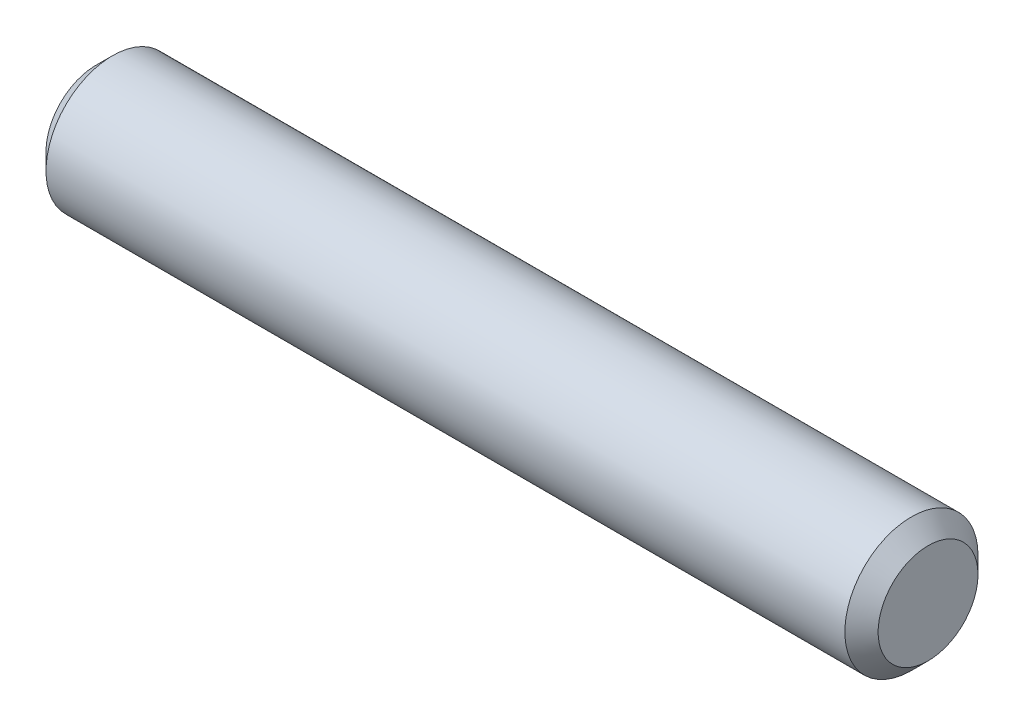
from build123d import *

# Parameters (mm, degrees)
ESQUISSE1_R          = 2
BASE_EXTRUSION_DEPTH = 25
CHANFREIN1_SIZE      = 0.5


with BuildPart() as part:
    # Esquisse1 → Base-Extrusion (new body)
    with BuildSketch(Plane(origin=(0, 0, 0), x_dir=(0, 0, -1), z_dir=(1, 0, 0))):
        Circle(ESQUISSE1_R)
    extrude(amount=BASE_EXTRUSION_DEPTH)

    # Chanfrein1
    chanfrein1_edges = [part.edges().sort_by_distance(p)[0] for p in [
        (0, 0, 2),
        (25, 0, 2),
    ]]
    chamfer(chanfrein1_edges, length=CHANFREIN1_SIZE)


solid = part.part
